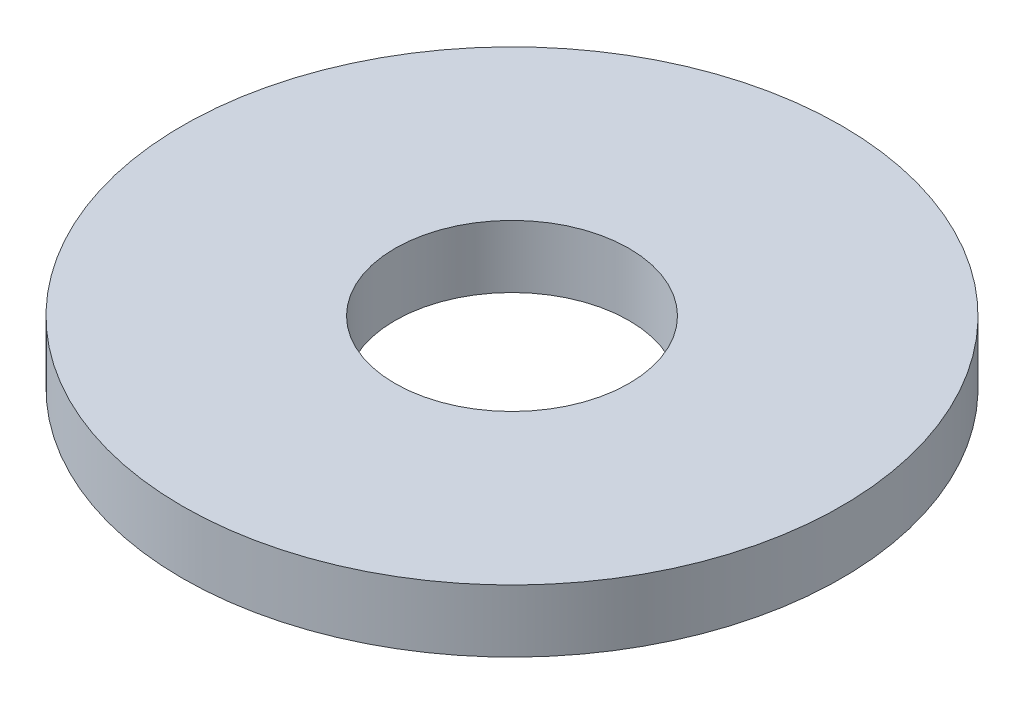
ISO-10303-21;
HEADER;
FILE_DESCRIPTION(('STEP AP214'),'2;1');
FILE_NAME('part.step','',(''),(''),'','','');
FILE_SCHEMA(('AUTOMOTIVE_DESIGN { 1 0 10303 214 1 1 1 1 }'));
ENDSEC;
DATA;
#1=APPLICATION_CONTEXT('core data for automotive mechanical design processes');
#2=APPLICATION_PROTOCOL_DEFINITION('international standard','automotive_design',2000,#1);
#3=PRODUCT_CONTEXT('',#1,'mechanical');
#4=PRODUCT('Part','Part','',(#3));
#5=PRODUCT_RELATED_PRODUCT_CATEGORY('part','',(#4));
#6=PRODUCT_DEFINITION_FORMATION('','',#4);
#7=PRODUCT_DEFINITION_CONTEXT('part definition',#1,'design');
#8=PRODUCT_DEFINITION('design','',#6,#7);
#9=PRODUCT_DEFINITION_SHAPE('','',#8);
#10=(LENGTH_UNIT() NAMED_UNIT(*) SI_UNIT(.MILLI.,.METRE.));
#11=(NAMED_UNIT(*) PLANE_ANGLE_UNIT() SI_UNIT($,.RADIAN.));
#12=(NAMED_UNIT(*) SI_UNIT($,.STERADIAN.) SOLID_ANGLE_UNIT());
#13=UNCERTAINTY_MEASURE_WITH_UNIT(LENGTH_MEASURE(1.E-05),#10,'distance_accuracy_value','');
#14=(GEOMETRIC_REPRESENTATION_CONTEXT(3) GLOBAL_UNCERTAINTY_ASSIGNED_CONTEXT((#13)) GLOBAL_UNIT_ASSIGNED_CONTEXT((#10,
#11,#12)) REPRESENTATION_CONTEXT('',''));
#15=CARTESIAN_POINT('',(0.,0.,0.));
#16=DIRECTION('',(0.,0.,1.));
#17=DIRECTION('',(1.,0.,0.));
#18=AXIS2_PLACEMENT_3D('',#15,#16,#17);
#19=CARTESIAN_POINT('',(0.,1.8034,0.));
#20=DIRECTION('',(0.,1.,0.));
#21=DIRECTION('',(0.,0.,1.));
#22=AXIS2_PLACEMENT_3D('',#19,#20,#21);
#23=PLANE('',#22);
#24=CARTESIAN_POINT('',(0.,1.8034,0.));
#25=DIRECTION('',(0.,1.,0.));
#26=DIRECTION('',(0.,0.,1.));
#27=AXIS2_PLACEMENT_3D('',#24,#25,#26);
#28=CIRCLE('',#27,9.5123);
#29=CARTESIAN_POINT('',(0.,1.8034,9.5123));
#30=VERTEX_POINT('',#29);
#31=EDGE_CURVE('E10',#30,#30,#28,.T.);
#32=ORIENTED_EDGE('',*,*,#31,.T.);
#33=EDGE_LOOP('',(#32));
#34=FACE_BOUND('',#33,.T.);
#35=CARTESIAN_POINT('',(0.,1.8034,0.));
#36=DIRECTION('',(0.,1.,0.));
#37=DIRECTION('',(0.,0.,1.));
#38=AXIS2_PLACEMENT_3D('',#35,#36,#37);
#39=CIRCLE('',#38,3.3782);
#40=CARTESIAN_POINT('',(0.,1.8034,3.3782));
#41=VERTEX_POINT('',#40);
#42=EDGE_CURVE('E50',#41,#41,#39,.T.);
#43=ORIENTED_EDGE('',*,*,#42,.F.);
#44=EDGE_LOOP('',(#43));
#45=FACE_BOUND('',#44,.T.);
#46=ADVANCED_FACE('F36',(#34,#45),#23,.T.);
#47=CARTESIAN_POINT('',(0.,0.,0.));
#48=DIRECTION('',(0.,1.,0.));
#49=DIRECTION('',(0.,0.,1.));
#50=AXIS2_PLACEMENT_3D('',#47,#48,#49);
#51=PLANE('',#50);
#52=CARTESIAN_POINT('',(0.,0.,0.));
#53=DIRECTION('',(0.,1.,0.));
#54=DIRECTION('',(0.,0.,1.));
#55=AXIS2_PLACEMENT_3D('',#52,#53,#54);
#56=CIRCLE('',#55,9.5123);
#57=CARTESIAN_POINT('',(0.,0.,9.5123));
#58=VERTEX_POINT('',#57);
#59=EDGE_CURVE('E40',#58,#58,#56,.T.);
#60=ORIENTED_EDGE('',*,*,#59,.F.);
#61=EDGE_LOOP('',(#60));
#62=FACE_BOUND('',#61,.T.);
#63=CARTESIAN_POINT('',(0.,0.,0.));
#64=DIRECTION('',(0.,1.,0.));
#65=DIRECTION('',(0.,0.,1.));
#66=AXIS2_PLACEMENT_3D('',#63,#64,#65);
#67=CIRCLE('',#66,3.3782);
#68=CARTESIAN_POINT('',(0.,0.,3.3782));
#69=VERTEX_POINT('',#68);
#70=EDGE_CURVE('E52',#69,#69,#67,.T.);
#71=ORIENTED_EDGE('',*,*,#70,.T.);
#72=EDGE_LOOP('',(#71));
#73=FACE_BOUND('',#72,.T.);
#74=ADVANCED_FACE('F63',(#62,#73),#51,.F.);
#75=CARTESIAN_POINT('',(0.,1.8034,0.));
#76=DIRECTION('',(0.,-1.,0.));
#77=DIRECTION('',(0.,0.,-1.));
#78=AXIS2_PLACEMENT_3D('',#75,#76,#77);
#79=CYLINDRICAL_SURFACE('',#78,9.5123);
#80=ORIENTED_EDGE('',*,*,#31,.F.);
#81=EDGE_LOOP('',(#80));
#82=FACE_BOUND('',#81,.T.);
#83=ORIENTED_EDGE('',*,*,#59,.T.);
#84=EDGE_LOOP('',(#83));
#85=FACE_BOUND('',#84,.T.);
#86=ADVANCED_FACE('F38',(#82,#85),#79,.T.);
#87=CARTESIAN_POINT('',(0.,1.8034,0.));
#88=DIRECTION('',(0.,-1.,0.));
#89=DIRECTION('',(0.,0.,-1.));
#90=AXIS2_PLACEMENT_3D('',#87,#88,#89);
#91=CYLINDRICAL_SURFACE('',#90,3.3782);
#92=ORIENTED_EDGE('',*,*,#42,.T.);
#93=EDGE_LOOP('',(#92));
#94=FACE_BOUND('',#93,.T.);
#95=ORIENTED_EDGE('',*,*,#70,.F.);
#96=EDGE_LOOP('',(#95));
#97=FACE_BOUND('',#96,.T.);
#98=ADVANCED_FACE('F59',(#94,#97),#91,.F.);
#99=CLOSED_SHELL('',(#46,#74,#86,#98));
#100=MANIFOLD_SOLID_BREP('B2',#99);
#101=ADVANCED_BREP_SHAPE_REPRESENTATION('',(#18,#100),#14);
#102=SHAPE_DEFINITION_REPRESENTATION(#9,#101);
ENDSEC;
END-ISO-10303-21;
